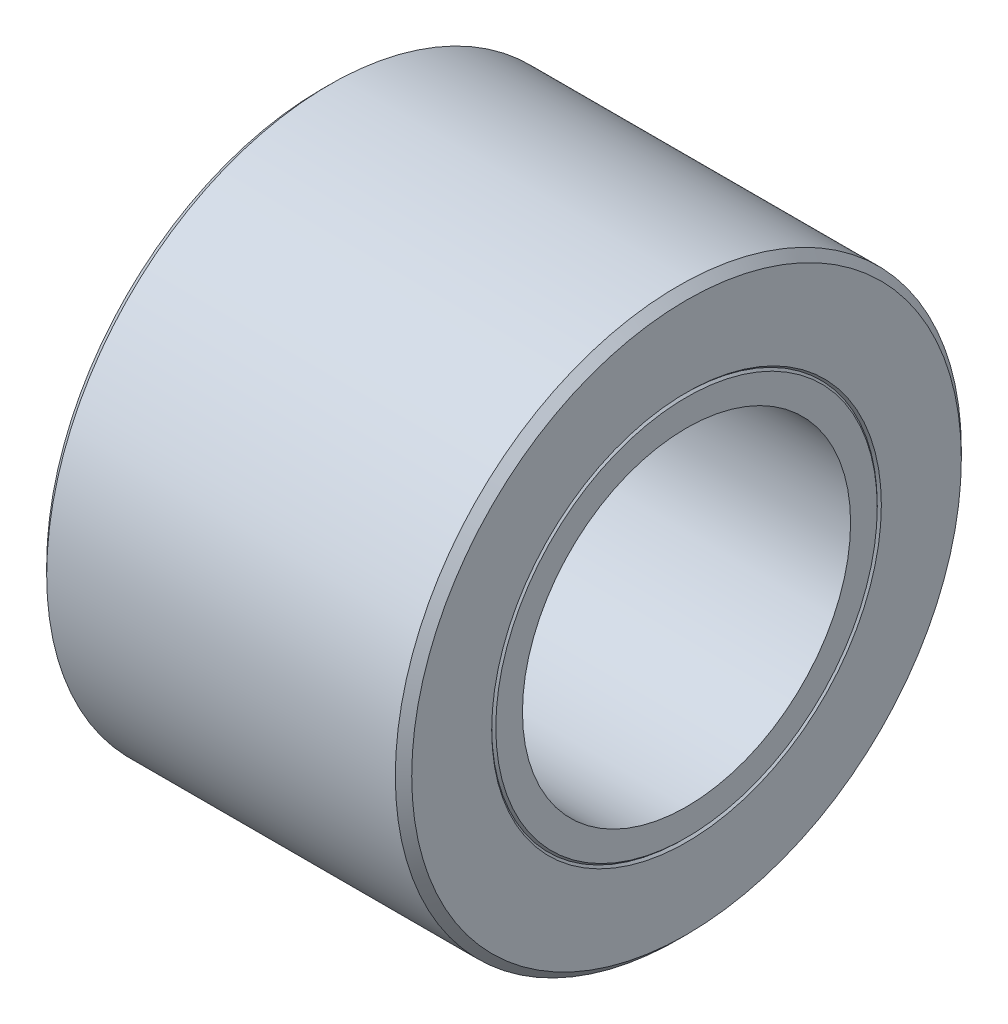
from build123d import *

# Parameters (mm, degrees)
ESQUISSE2_R             = 2.375
ESQUISSE2_R_2           = 2.325
ENL_V_MAT_EXTRU_1_DEPTH = 0.1
ENL_V_MAT_EXTRU_1_TAPER = 45


with BuildPart() as part:
    # Esquisse1 → R_volution1 (revolve)
    with BuildSketch(Plane.XY, mode=Mode.PRIVATE) as r_volution1_sk:
        Polygon((0, 2), (4.45, 2), (4.45, 3.35), (4.35, 3.45), (0.1, 3.45), (0, 3.35), align=None)
    revolve(r_volution1_sk.sketch.rotate(Axis((0, 0, 0), (1, 0, 0)), 90), axis=Axis((0, 0, 0), (1, 0, 0)))

    # Esquisse2 → Enl_v. mat.-Extru.1 (cut)
    with BuildSketch(Plane(origin=(4.45, 0, 0), x_dir=(0, 0, -1), z_dir=(1, 0, 0))):
        Circle(ESQUISSE2_R)
        Circle(ESQUISSE2_R_2, mode=Mode.SUBTRACT)
    extrude(amount=-ENL_V_MAT_EXTRU_1_DEPTH, taper=ENL_V_MAT_EXTRU_1_TAPER, mode=Mode.SUBTRACT)


solid = part.part
